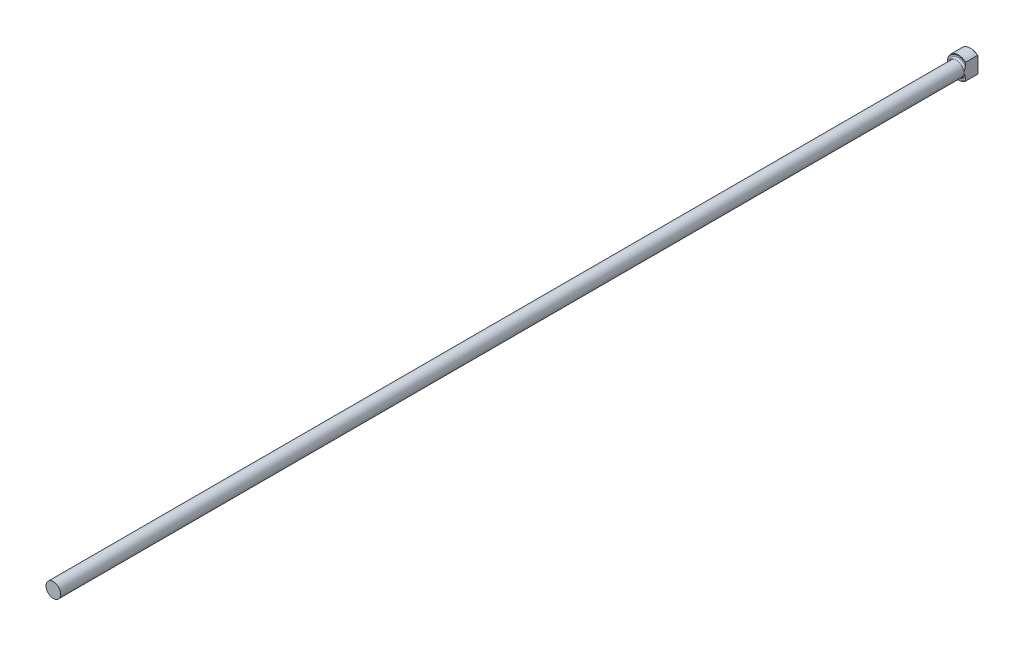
ISO-10303-21;
HEADER;
FILE_DESCRIPTION(('STEP AP214'),'2;1');
FILE_NAME('part.step','',(''),(''),'','','');
FILE_SCHEMA(('AUTOMOTIVE_DESIGN { 1 0 10303 214 1 1 1 1 }'));
ENDSEC;
DATA;
#1=APPLICATION_CONTEXT('core data for automotive mechanical design processes');
#2=APPLICATION_PROTOCOL_DEFINITION('international standard','automotive_design',2000,#1);
#3=PRODUCT_CONTEXT('',#1,'mechanical');
#4=PRODUCT('Part','Part','',(#3));
#5=PRODUCT_RELATED_PRODUCT_CATEGORY('part','',(#4));
#6=PRODUCT_DEFINITION_FORMATION('','',#4);
#7=PRODUCT_DEFINITION_CONTEXT('part definition',#1,'design');
#8=PRODUCT_DEFINITION('design','',#6,#7);
#9=PRODUCT_DEFINITION_SHAPE('','',#8);
#10=(LENGTH_UNIT() NAMED_UNIT(*) SI_UNIT(.MILLI.,.METRE.));
#11=(NAMED_UNIT(*) PLANE_ANGLE_UNIT() SI_UNIT($,.RADIAN.));
#12=(NAMED_UNIT(*) SI_UNIT($,.STERADIAN.) SOLID_ANGLE_UNIT());
#13=UNCERTAINTY_MEASURE_WITH_UNIT(LENGTH_MEASURE(1.E-05),#10,'distance_accuracy_value','');
#14=(GEOMETRIC_REPRESENTATION_CONTEXT(3) GLOBAL_UNCERTAINTY_ASSIGNED_CONTEXT((#13)) GLOBAL_UNIT_ASSIGNED_CONTEXT((#10,
#11,#12)) REPRESENTATION_CONTEXT('',''));
#15=CARTESIAN_POINT('',(0.,0.,0.));
#16=DIRECTION('',(0.,0.,1.));
#17=DIRECTION('',(1.,0.,0.));
#18=AXIS2_PLACEMENT_3D('',#15,#16,#17);
#19=CARTESIAN_POINT('',(0.,3.63473999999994,457.2));
#20=DIRECTION('',(0.,0.,1.));
#21=DIRECTION('',(1.,0.,0.));
#22=AXIS2_PLACEMENT_3D('',#19,#20,#21);
#23=PLANE('',#22);
#24=CARTESIAN_POINT('',(0.,0.,457.2));
#25=DIRECTION('',(0.,0.,-1.));
#26=DIRECTION('',(-1.,0.,0.));
#27=AXIS2_PLACEMENT_3D('',#24,#25,#26);
#28=CIRCLE('',#27,3.63473999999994);
#29=CARTESIAN_POINT('',(-3.63473999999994,0.,457.2));
#30=VERTEX_POINT('',#29);
#31=EDGE_CURVE('E96',#30,#30,#28,.T.);
#32=ORIENTED_EDGE('',*,*,#31,.F.);
#33=EDGE_LOOP('',(#32));
#34=FACE_BOUND('',#33,.T.);
#35=ADVANCED_FACE('F32',(#34),#23,.T.);
#36=CARTESIAN_POINT('',(0.,0.,-25.4347445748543));
#37=DIRECTION('',(0.,0.,-1.));
#38=DIRECTION('',(-1.,0.,0.));
#39=AXIS2_PLACEMENT_3D('',#36,#37,#38);
#40=CYLINDRICAL_SURFACE('',#39,3.63473999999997);
#41=ORIENTED_EDGE('',*,*,#31,.T.);
#42=EDGE_LOOP('',(#41));
#43=FACE_BOUND('',#42,.T.);
#44=CARTESIAN_POINT('',(0.,0.,7.112));
#45=DIRECTION('',(0.,0.,-1.));
#46=DIRECTION('',(-1.,0.,0.));
#47=AXIS2_PLACEMENT_3D('',#44,#45,#46);
#48=CIRCLE('',#47,3.63474);
#49=CARTESIAN_POINT('',(3.63474,0.,7.112));
#50=VERTEX_POINT('',#49);
#51=EDGE_CURVE('E101',#50,#50,#48,.T.);
#52=ORIENTED_EDGE('',*,*,#51,.F.);
#53=EDGE_LOOP('',(#52));
#54=FACE_BOUND('',#53,.T.);
#55=ADVANCED_FACE('F158',(#43,#54),#40,.T.);
#56=CARTESIAN_POINT('',(0.,0.,7.112));
#57=DIRECTION('',(0.,0.,-1.));
#58=DIRECTION('',(-1.,0.,0.));
#59=AXIS2_PLACEMENT_3D('',#56,#57,#58);
#60=TOROIDAL_SURFACE('',#59,4.39674,0.761999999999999);
#61=CARTESIAN_POINT('',(3.63474,0.,7.112));
#62=CARTESIAN_POINT('',(3.63474,-1.74344946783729E-12,7.11199899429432));
#63=CARTESIAN_POINT('',(3.63474,1.78498334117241E-07,7.11199798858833));
#64=CARTESIAN_POINT('',(3.63474,7.62263791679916E-07,7.11199603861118));
#65=CARTESIAN_POINT('',(3.63474,1.17158642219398E-06,7.11199509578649));
#66=CARTESIAN_POINT('',(3.63474,2.1612376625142E-06,7.11199322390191));
#67=CARTESIAN_POINT('',(3.63474,2.75126191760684E-06,7.11199230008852));
#68=CARTESIAN_POINT('',(3.63474,4.03652646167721E-06,7.11199053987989));
#69=CARTESIAN_POINT('',(3.63474,4.73118020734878E-06,7.11198970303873));
#70=CARTESIAN_POINT('',(3.63474,7.18105103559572E-06,7.11198696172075));
#71=CARTESIAN_POINT('',(3.63474,9.07519299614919E-06,7.11198518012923));
#72=CARTESIAN_POINT('',(3.63474,1.30322584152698E-05,7.11198194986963));
#73=CARTESIAN_POINT('',(3.63474,1.50893158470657E-05,7.11198049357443));
#74=CARTESIAN_POINT('',(3.63474,2.29434135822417E-05,7.11197518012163));
#75=CARTESIAN_POINT('',(3.63474,2.89441356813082E-05,7.11197161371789));
#76=CARTESIAN_POINT('',(3.63474,4.09147041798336E-05,7.11196563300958));
#77=CARTESIAN_POINT('',(3.63474,4.68525012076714E-05,7.11196315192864));
#78=CARTESIAN_POINT('',(3.63474,7.1644418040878E-05,7.11195289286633));
#79=CARTESIAN_POINT('',(3.63474,9.05656834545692E-05,7.11194530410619));
#80=CARTESIAN_POINT('',(3.63474,0.000126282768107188,7.11193284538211));
#81=CARTESIAN_POINT('',(3.63474,0.000142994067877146,7.11192774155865));
#82=CARTESIAN_POINT('',(3.63474,0.000262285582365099,7.11188809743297));
#83=CARTESIAN_POINT('',(3.63474,0.000359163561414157,7.11183858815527));
#84=CARTESIAN_POINT('',(3.63474,0.000732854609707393,7.11165477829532));
#85=CARTESIAN_POINT('',(3.63474,0.00101364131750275,7.11153159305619));
#86=CARTESIAN_POINT('',(3.63473999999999,0.00209315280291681,7.11105073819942));
#87=CARTESIAN_POINT('',(3.63474,0.0028877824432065,7.11068142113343));
#88=CARTESIAN_POINT('',(3.63474,0.00610639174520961,7.10919295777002));
#89=CARTESIAN_POINT('',(3.63474,0.00853491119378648,7.10808693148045));
#90=CARTESIAN_POINT('',(3.63473999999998,0.0422909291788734,7.09270387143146));
#91=CARTESIAN_POINT('',(3.63473999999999,0.0735849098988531,7.07832930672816));
#92=CARTESIAN_POINT('',(3.63474,0.136642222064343,7.04947209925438));
#93=CARTESIAN_POINT('',(3.63474,0.168406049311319,7.03499071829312));
#94=CARTESIAN_POINT('',(3.63473999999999,0.261065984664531,6.99286174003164));
#95=CARTESIAN_POINT('',(3.63474,0.322003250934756,6.96530107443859));
#96=CARTESIAN_POINT('',(3.63474,0.450965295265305,6.90766146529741));
#97=CARTESIAN_POINT('',(3.63474,0.519018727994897,6.87764661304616));
#98=CARTESIAN_POINT('',(3.63474,0.656239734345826,6.81834826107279));
#99=CARTESIAN_POINT('',(3.63474,0.72541168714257,6.78907483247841));
#100=CARTESIAN_POINT('',(3.63474,0.847105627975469,6.73906299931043));
#101=CARTESIAN_POINT('',(3.63474,0.899497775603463,6.71800992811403));
#102=CARTESIAN_POINT('',(3.63474,1.00454845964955,6.67695428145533));
#103=CARTESIAN_POINT('',(3.63474,1.05720607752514,6.65694934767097));
#104=CARTESIAN_POINT('',(3.63474,1.21365089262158,6.59952009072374));
#105=CARTESIAN_POINT('',(3.63474,1.31807181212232,6.56377668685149));
#106=CARTESIAN_POINT('',(3.63474,1.49628557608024,6.50859760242));
#107=CARTESIAN_POINT('',(3.63474,1.56957331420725,6.48753547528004));
#108=CARTESIAN_POINT('',(3.63474,1.71750588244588,6.44892937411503));
#109=CARTESIAN_POINT('',(3.63474,1.79215591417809,6.43140508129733));
#110=CARTESIAN_POINT('',(3.63474,1.94621928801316,6.40000137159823));
#111=CARTESIAN_POINT('',(3.63474,2.02568099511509,6.38635418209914));
#112=CARTESIAN_POINT('',(3.63474,2.18539345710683,6.36502426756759));
#113=CARTESIAN_POINT('',(3.63474,2.26564390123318,6.35733928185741));
#114=CARTESIAN_POINT('',(3.63474,2.4403343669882,6.34851963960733));
#115=CARTESIAN_POINT('',(3.63474,2.53485308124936,6.34873058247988));
#116=CARTESIAN_POINT('',(3.63474,2.72206173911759,6.36165439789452));
#117=CARTESIAN_POINT('',(3.63474,2.81475996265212,6.37421570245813));
#118=CARTESIAN_POINT('',(3.63474,2.97031424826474,6.40897537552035));
#119=CARTESIAN_POINT('',(3.63474,3.03401911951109,6.4273158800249));
#120=CARTESIAN_POINT('',(3.63474,3.15819399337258,6.47330401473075));
#121=CARTESIAN_POINT('',(3.63474,3.21866165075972,6.5009582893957));
#122=CARTESIAN_POINT('',(3.63474,3.31632345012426,6.55712349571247));
#123=CARTESIAN_POINT('',(3.63474,3.35507555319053,6.5829127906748));
#124=CARTESIAN_POINT('',(3.63474,3.42814101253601,6.6401577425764));
#125=CARTESIAN_POINT('',(3.63474,3.46246250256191,6.67160275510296));
#126=CARTESIAN_POINT('',(3.63474,3.51821035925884,6.73294148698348));
#127=CARTESIAN_POINT('',(3.63474,3.54082748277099,6.76174753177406));
#128=CARTESIAN_POINT('',(3.63474,3.58108240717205,6.82268617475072));
#129=CARTESIAN_POINT('',(3.63474,3.59872205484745,6.85481753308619));
#130=CARTESIAN_POINT('',(3.63474,3.62801553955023,6.92207308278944));
#131=CARTESIAN_POINT('',(3.63474,3.63961636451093,6.95722072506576));
#132=CARTESIAN_POINT('',(3.63474,3.65563254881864,7.02911724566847));
#133=CARTESIAN_POINT('',(3.63474,3.66005463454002,7.06586459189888));
#134=CARTESIAN_POINT('',(3.63474,3.66124171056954,7.13429247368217));
#135=CARTESIAN_POINT('',(3.63474,3.65899524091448,7.16595948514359));
#136=CARTESIAN_POINT('',(3.63474,3.64908172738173,7.2284247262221));
#137=CARTESIAN_POINT('',(3.63474,3.64141514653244,7.25922302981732));
#138=CARTESIAN_POINT('',(3.63474,3.62137123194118,7.31848664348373));
#139=CARTESIAN_POINT('',(3.63474,3.60909861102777,7.34698785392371));
#140=CARTESIAN_POINT('',(3.63474,3.58048272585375,7.40185007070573));
#141=CARTESIAN_POINT('',(3.63474,3.56413806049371,7.42821033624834));
#142=CARTESIAN_POINT('',(3.63474,3.5206361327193,7.48883472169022));
#143=CARTESIAN_POINT('',(3.63474,3.49179605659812,7.52189344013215));
#144=CARTESIAN_POINT('',(3.63474,3.42913585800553,7.58291812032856));
#145=CARTESIAN_POINT('',(3.63474,3.39530386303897,7.61087157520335));
#146=CARTESIAN_POINT('',(3.63474,3.30942968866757,7.67233440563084));
#147=CARTESIAN_POINT('',(3.63474,3.25563153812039,7.7033809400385));
#148=CARTESIAN_POINT('',(3.63474,3.14400577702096,7.75659339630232));
#149=CARTESIAN_POINT('',(3.63474,3.08617990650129,7.77876312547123));
#150=CARTESIAN_POINT('',(3.63474,2.93528161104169,7.8257752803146));
#151=CARTESIAN_POINT('',(3.63474,2.84054021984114,7.84521095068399));
#152=CARTESIAN_POINT('',(3.63474,2.64821810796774,7.8697939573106));
#153=CARTESIAN_POINT('',(3.63474,2.55061639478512,7.87474836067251));
#154=CARTESIAN_POINT('',(3.63474,2.36383615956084,7.87314445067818));
#155=CARTESIAN_POINT('',(3.63474,2.27464176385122,7.86752224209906));
#156=CARTESIAN_POINT('',(3.63474,2.09692980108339,7.84845083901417));
#157=CARTESIAN_POINT('',(3.63474,2.00841429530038,7.83498343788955));
#158=CARTESIAN_POINT('',(3.63474,1.83711061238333,7.80260031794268));
#159=CARTESIAN_POINT('',(3.63474,1.75426130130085,7.78399899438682));
#160=CARTESIAN_POINT('',(3.63474,1.59022963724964,7.74231897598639));
#161=CARTESIAN_POINT('',(3.63474,1.50904037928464,7.71926703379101));
#162=CARTESIAN_POINT('',(3.63474,1.32276260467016,7.66178077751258));
#163=CARTESIAN_POINT('',(3.63474,1.21808139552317,7.62603474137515));
#164=CARTESIAN_POINT('',(3.63474,1.06123677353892,7.56856460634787));
#165=CARTESIAN_POINT('',(3.63474,1.00843579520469,7.5485365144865));
#166=CARTESIAN_POINT('',(3.63474,0.903101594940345,7.5074250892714));
#167=CARTESIAN_POINT('',(3.63474,0.850569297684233,7.48633937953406));
#168=CARTESIAN_POINT('',(3.63474,0.728434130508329,7.43619381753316));
#169=CARTESIAN_POINT('',(3.63474,0.658963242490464,7.40681377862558));
#170=CARTESIAN_POINT('',(3.63474,0.521152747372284,7.34728987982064));
#171=CARTESIAN_POINT('',(3.63474,0.452808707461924,7.31715621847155));
#172=CARTESIAN_POINT('',(3.63474,0.323301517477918,7.25928448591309));
#173=CARTESIAN_POINT('',(3.63473999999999,0.262109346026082,7.23161133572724));
#174=CARTESIAN_POINT('',(3.63474,0.169062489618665,7.18930864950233));
#175=CARTESIAN_POINT('',(3.63474,0.137166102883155,7.17476722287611));
#176=CARTESIAN_POINT('',(3.63473999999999,0.0738458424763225,7.14579006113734));
#177=CARTESIAN_POINT('',(3.63473999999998,0.0424214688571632,7.13135559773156));
#178=CARTESIAN_POINT('',(3.63474,0.0085348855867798,7.11591305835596));
#179=CARTESIAN_POINT('',(3.63474,0.00610634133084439,7.11480701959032));
#180=CARTESIAN_POINT('',(3.63474,0.00288772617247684,7.11331855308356));
#181=CARTESIAN_POINT('',(3.63473999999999,0.00209311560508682,7.11294924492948));
#182=CARTESIAN_POINT('',(3.63474,0.00101362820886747,7.11246840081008));
#183=CARTESIAN_POINT('',(3.63474,0.000732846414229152,7.11234521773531));
#184=CARTESIAN_POINT('',(3.63474,0.00035916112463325,7.11216141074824));
#185=CARTESIAN_POINT('',(3.63474,0.000262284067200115,7.1121119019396));
#186=CARTESIAN_POINT('',(3.63474,0.000142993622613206,7.11207225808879));
#187=CARTESIAN_POINT('',(3.63474,0.00012628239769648,7.11206715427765));
#188=CARTESIAN_POINT('',(3.63474,9.05654743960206E-05,7.11205469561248));
#189=CARTESIAN_POINT('',(3.63474,7.16442934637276E-05,7.11204710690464));
#190=CARTESIAN_POINT('',(3.63474,4.68524715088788E-05,7.11203684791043));
#191=CARTESIAN_POINT('',(3.63474,4.09146867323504E-05,7.11203436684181));
#192=CARTESIAN_POINT('',(3.63474,2.89441407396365E-05,7.11202838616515));
#193=CARTESIAN_POINT('',(3.63474,2.294342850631E-05,7.11202481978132));
#194=CARTESIAN_POINT('',(3.63474,1.50893396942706E-05,7.11201950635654));
#195=CARTESIAN_POINT('',(3.63474,1.30322831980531E-05,7.11201805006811));
#196=CARTESIAN_POINT('',(3.63474,9.07521827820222E-06,7.11201481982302));
#197=CARTESIAN_POINT('',(3.63474,7.18107583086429E-06,7.11201303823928));
#198=CARTESIAN_POINT('',(3.63474,4.73120269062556E-06,7.11201029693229));
#199=CARTESIAN_POINT('',(3.63474,4.03654795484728E-06,7.11200946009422));
#200=CARTESIAN_POINT('',(3.63474,2.75128088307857E-06,7.11200769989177));
#201=CARTESIAN_POINT('',(3.63474,2.16125508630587E-06,7.11200677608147));
#202=CARTESIAN_POINT('',(3.63474,1.1716001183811E-06,7.11200490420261));
#203=CARTESIAN_POINT('',(3.63474,7.62275360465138E-07,7.11200396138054));
#204=CARTESIAN_POINT('',(3.63474,1.78504786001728E-07,7.11200201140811));
#205=CARTESIAN_POINT('',(3.63474,1.74383367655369E-12,7.11200100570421));
#206=CARTESIAN_POINT('',(3.63474,0.,7.112));
#207=B_SPLINE_CURVE_WITH_KNOTS('',3,(#61,#62,#63,#64,#65,#66,#67,#68,#69,#70,#71,#72,#73,#74,
#75,#76,#77,#78,#79,#80,#81,#82,#83,#84,#85,#86,#87,#88,#89,#90,#91,#92,#93,#94,#95,#96,#97,#98,
#99,#100,#101,#102,#103,#104,#105,#106,#107,#108,#109,#110,#111,#112,#113,#114,#115,#116,#117,
#118,#119,#120,#121,#122,#123,#124,#125,#126,#127,#128,#129,#130,#131,#132,#133,#134,#135,#136,
#137,#138,#139,#140,#141,#142,#143,#144,#145,#146,#147,#148,#149,#150,#151,#152,#153,#154,#155,
#156,#157,#158,#159,#160,#161,#162,#163,#164,#165,#166,#167,#168,#169,#170,#171,#172,#173,#174,
#175,#176,#177,#178,#179,#180,#181,#182,#183,#184,#185,#186,#187,#188,#189,#190,#191,#192,#193,
#194,#195,#196,#197,#198,#199,#200,#201,#202,#203,#204,#205,#206),.UNSPECIFIED.,.T.,.F.,(4,2,2,
2,2,2,2,2,2,2,2,2,2,2,2,2,2,2,2,2,2,2,2,2,2,2,2,2,2,2,2,2,2,2,2,2,2,2,2,2,2,2,2,2,2,2,2,2,2,2,2,
2,2,2,2,2,2,2,2,2,2,2,2,2,2,2,2,2,2,2,2,2,4),(0.,3.01414719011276E-06,6.08300473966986E-06,
9.35948019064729E-06,1.26182282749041E-05,2.03807095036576E-05,2.79356666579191E-05,
4.88018920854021E-05,6.80885541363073E-05,0.000129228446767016,0.00018159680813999,
0.000506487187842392,0.00142754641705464,0.00405483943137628,0.0120619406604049,
0.115361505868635,0.220092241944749,0.420728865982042,0.643859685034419,0.869180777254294,
1.03856258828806,1.20754529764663,1.53848522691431,1.76717479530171,1.99710350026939,
2.23879063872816,2.48038609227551,2.76331480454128,3.04281411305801,3.24114783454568,
3.43962334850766,3.57883259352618,3.71778252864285,3.82723637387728,3.93664955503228,
4.04700768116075,4.15726234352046,4.25202603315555,4.34678162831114,4.43950208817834,
4.53225449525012,4.6631354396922,4.79433283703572,4.97963569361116,5.16485898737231,
5.45339712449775,5.74576229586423,6.01345941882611,6.28178028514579,6.53635772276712,
6.78945003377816,7.12113276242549,7.29054177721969,7.46035016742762,7.68662149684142,
7.91069373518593,8.11216614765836,8.21733347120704,8.32106345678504,8.32907064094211,
8.3316978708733,8.33261891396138,8.33294380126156,8.3329961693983,8.33305730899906,
8.33307659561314,8.33309746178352,8.3331050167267,8.33311277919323,8.3331160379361,
8.33311931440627,8.3331223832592,8.33312539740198),.UNSPECIFIED.);
#208=CARTESIAN_POINT('',(3.63474,2.47386090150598,6.35));
#209=VERTEX_POINT('',#208);
#210=EDGE_CURVE('E136',#50,#209,#207,.T.);
#211=ORIENTED_EDGE('',*,*,#210,.T.);
#212=CARTESIAN_POINT('',(0.,0.,6.35));
#213=DIRECTION('',(0.,0.,-1.));
#214=DIRECTION('',(-1.,0.,0.));
#215=AXIS2_PLACEMENT_3D('',#212,#213,#214);
#216=CIRCLE('',#215,4.39674);
#217=CARTESIAN_POINT('',(3.63474,-2.47386090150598,6.35));
#218=VERTEX_POINT('',#217);
#219=EDGE_CURVE('E149',#218,#209,#216,.T.);
#220=ORIENTED_EDGE('',*,*,#219,.F.);
#221=CARTESIAN_POINT('',(3.63474,0.,7.112));
#222=CARTESIAN_POINT('',(3.63474,1.74370309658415E-12,7.11200100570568));
#223=CARTESIAN_POINT('',(3.63474,-1.78498333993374E-07,7.11200201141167));
#224=CARTESIAN_POINT('',(3.63474,-7.62263791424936E-07,7.11200396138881));
#225=CARTESIAN_POINT('',(3.63474,-1.17158642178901E-06,7.1120049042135));
#226=CARTESIAN_POINT('',(3.63474,-2.16123766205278E-06,7.11200677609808));
#227=CARTESIAN_POINT('',(3.63474,-2.75126191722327E-06,7.11200769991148));
#228=CARTESIAN_POINT('',(3.63474,-4.03652646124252E-06,7.11200946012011));
#229=CARTESIAN_POINT('',(3.63474,-4.73118020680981E-06,7.11201029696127));
#230=CARTESIAN_POINT('',(3.63474,-7.18105103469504E-06,7.11201303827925));
#231=CARTESIAN_POINT('',(3.63474,-9.0751929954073E-06,7.11201481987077));
#232=CARTESIAN_POINT('',(3.63474,-1.30322584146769E-05,7.11201805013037));
#233=CARTESIAN_POINT('',(3.63474,-1.50893158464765E-05,7.11201950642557));
#234=CARTESIAN_POINT('',(3.63474,-2.29434135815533E-05,7.11202481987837));
#235=CARTESIAN_POINT('',(3.63474,-2.8944135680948E-05,7.1120283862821));
#236=CARTESIAN_POINT('',(3.63474,-4.09147041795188E-05,7.11203436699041));
#237=CARTESIAN_POINT('',(3.63474,-4.68525012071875E-05,7.11203684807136));
#238=CARTESIAN_POINT('',(3.63474,-7.16444180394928E-05,7.11204710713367));
#239=CARTESIAN_POINT('',(3.63474,-9.05656834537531E-05,7.11205469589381));
#240=CARTESIAN_POINT('',(3.63474,-0.000126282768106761,7.11206715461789));
#241=CARTESIAN_POINT('',(3.63474,-0.000142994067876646,7.11207225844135));
#242=CARTESIAN_POINT('',(3.63473999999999,-0.000262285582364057,7.11211190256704));
#243=CARTESIAN_POINT('',(3.63474,-0.000359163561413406,7.11216141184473));
#244=CARTESIAN_POINT('',(3.63474,-0.000732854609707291,7.11234522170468));
#245=CARTESIAN_POINT('',(3.63474,-0.00101364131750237,7.11246840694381));
#246=CARTESIAN_POINT('',(3.63473999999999,-0.00209315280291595,7.11294926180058));
#247=CARTESIAN_POINT('',(3.63473999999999,-0.00288778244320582,7.11331857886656));
#248=CARTESIAN_POINT('',(3.63474,-0.00610639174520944,7.11480704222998));
#249=CARTESIAN_POINT('',(3.63474,-0.00853491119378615,7.11591306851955));
#250=CARTESIAN_POINT('',(3.63473999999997,-0.0422909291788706,7.13129612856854));
#251=CARTESIAN_POINT('',(3.63473999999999,-0.0735849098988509,7.14567069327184));
#252=CARTESIAN_POINT('',(3.63474,-0.136642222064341,7.17452790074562));
#253=CARTESIAN_POINT('',(3.63474,-0.168406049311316,7.18900928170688));
#254=CARTESIAN_POINT('',(3.63473999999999,-0.261065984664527,7.23113825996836));
#255=CARTESIAN_POINT('',(3.63473999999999,-0.322003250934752,7.25869892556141));
#256=CARTESIAN_POINT('',(3.63474,-0.450965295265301,7.31633853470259));
#257=CARTESIAN_POINT('',(3.63474,-0.519018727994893,7.34635338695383));
#258=CARTESIAN_POINT('',(3.63474,-0.656239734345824,7.40565173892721));
#259=CARTESIAN_POINT('',(3.63474,-0.725411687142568,7.43492516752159));
#260=CARTESIAN_POINT('',(3.63474,-0.847105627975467,7.48493700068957));
#261=CARTESIAN_POINT('',(3.63474,-0.899497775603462,7.50599007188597));
#262=CARTESIAN_POINT('',(3.63474,-1.00454845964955,7.54704571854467));
#263=CARTESIAN_POINT('',(3.63474,-1.05720607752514,7.56705065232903));
#264=CARTESIAN_POINT('',(3.63474,-1.21365089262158,7.62447990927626));
#265=CARTESIAN_POINT('',(3.63474,-1.31807181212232,7.66022331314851));
#266=CARTESIAN_POINT('',(3.63474,-1.49628557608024,7.71540239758));
#267=CARTESIAN_POINT('',(3.63474,-1.56957331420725,7.73646452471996));
#268=CARTESIAN_POINT('',(3.63474,-1.71750588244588,7.77507062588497));
#269=CARTESIAN_POINT('',(3.63474,-1.79215591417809,7.79259491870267));
#270=CARTESIAN_POINT('',(3.63474,-1.94621928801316,7.82399862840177));
#271=CARTESIAN_POINT('',(3.63474,-2.02568099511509,7.83764581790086));
#272=CARTESIAN_POINT('',(3.63474,-2.18539345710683,7.85897573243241));
#273=CARTESIAN_POINT('',(3.63474,-2.26564390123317,7.86666071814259));
#274=CARTESIAN_POINT('',(3.63474,-2.4403343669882,7.87548036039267));
#275=CARTESIAN_POINT('',(3.63474,-2.53485308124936,7.87526941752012));
#276=CARTESIAN_POINT('',(3.63474,-2.72206173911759,7.86234560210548));
#277=CARTESIAN_POINT('',(3.63474,-2.81475996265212,7.84978429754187));
#278=CARTESIAN_POINT('',(3.63474,-2.97031424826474,7.81502462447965));
#279=CARTESIAN_POINT('',(3.63474,-3.03401911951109,7.7966841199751));
#280=CARTESIAN_POINT('',(3.63474,-3.15819399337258,7.75069598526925));
#281=CARTESIAN_POINT('',(3.63474,-3.21866165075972,7.7230417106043));
#282=CARTESIAN_POINT('',(3.63474,-3.31632345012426,7.66687650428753));
#283=CARTESIAN_POINT('',(3.63474,-3.35507555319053,7.6410872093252));
#284=CARTESIAN_POINT('',(3.63474,-3.428141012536,7.5838422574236));
#285=CARTESIAN_POINT('',(3.63474,-3.46246250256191,7.55239724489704));
#286=CARTESIAN_POINT('',(3.63474,-3.51821035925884,7.49105851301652));
#287=CARTESIAN_POINT('',(3.63474,-3.54082748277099,7.46225246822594));
#288=CARTESIAN_POINT('',(3.63474,-3.58108240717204,7.40131382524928));
#289=CARTESIAN_POINT('',(3.63474,-3.59872205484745,7.36918246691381));
#290=CARTESIAN_POINT('',(3.63474,-3.62801553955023,7.30192691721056));
#291=CARTESIAN_POINT('',(3.63474,-3.63961636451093,7.26677927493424));
#292=CARTESIAN_POINT('',(3.63474,-3.65563254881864,7.19488275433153));
#293=CARTESIAN_POINT('',(3.63474,-3.66005463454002,7.15813540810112));
#294=CARTESIAN_POINT('',(3.63474,-3.66124171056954,7.08970752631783));
#295=CARTESIAN_POINT('',(3.63474,-3.65899524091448,7.05804051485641));
#296=CARTESIAN_POINT('',(3.63474,-3.64908172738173,6.9955752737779));
#297=CARTESIAN_POINT('',(3.63474,-3.64141514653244,6.96477697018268));
#298=CARTESIAN_POINT('',(3.63474,-3.62137123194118,6.90551335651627));
#299=CARTESIAN_POINT('',(3.63474,-3.60909861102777,6.87701214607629));
#300=CARTESIAN_POINT('',(3.63474,-3.58048272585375,6.82214992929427));
#301=CARTESIAN_POINT('',(3.63474,-3.56413806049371,6.79578966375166));
#302=CARTESIAN_POINT('',(3.63474,-3.5206361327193,6.73516527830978));
#303=CARTESIAN_POINT('',(3.63474,-3.49179605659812,6.70210655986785));
#304=CARTESIAN_POINT('',(3.63474,-3.42913585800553,6.64108187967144));
#305=CARTESIAN_POINT('',(3.63474,-3.39530386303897,6.61312842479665));
#306=CARTESIAN_POINT('',(3.63474,-3.30942968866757,6.55166559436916));
#307=CARTESIAN_POINT('',(3.63474,-3.25563153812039,6.5206190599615));
#308=CARTESIAN_POINT('',(3.63474,-3.14400577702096,6.46740660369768));
#309=CARTESIAN_POINT('',(3.63474,-3.08617990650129,6.44523687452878));
#310=CARTESIAN_POINT('',(3.63474,-2.93528161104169,6.3982247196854));
#311=CARTESIAN_POINT('',(3.63474,-2.84054021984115,6.37878904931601));
#312=CARTESIAN_POINT('',(3.63474,-2.64821810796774,6.3542060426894));
#313=CARTESIAN_POINT('',(3.63474,-2.55061639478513,6.34925163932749));
#314=CARTESIAN_POINT('',(3.63474,-2.36383615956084,6.35085554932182));
#315=CARTESIAN_POINT('',(3.63474,-2.27464176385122,6.35647775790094));
#316=CARTESIAN_POINT('',(3.63474,-2.0969298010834,6.37554916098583));
#317=CARTESIAN_POINT('',(3.63474,-2.00841429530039,6.38901656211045));
#318=CARTESIAN_POINT('',(3.63474,-1.83711061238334,6.42139968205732));
#319=CARTESIAN_POINT('',(3.63474,-1.75426130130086,6.44000100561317));
#320=CARTESIAN_POINT('',(3.63474,-1.59022963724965,6.48168102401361));
#321=CARTESIAN_POINT('',(3.63474,-1.50904037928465,6.50473296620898));
#322=CARTESIAN_POINT('',(3.63474,-1.32276260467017,6.56221922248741));
#323=CARTESIAN_POINT('',(3.63474,-1.21808139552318,6.59796525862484));
#324=CARTESIAN_POINT('',(3.63474,-1.06123677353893,6.65543539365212));
#325=CARTESIAN_POINT('',(3.63474,-1.00843579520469,6.6754634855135));
#326=CARTESIAN_POINT('',(3.63474,-0.903101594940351,6.71657491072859));
#327=CARTESIAN_POINT('',(3.63474,-0.850569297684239,6.73766062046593));
#328=CARTESIAN_POINT('',(3.63474,-0.728434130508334,6.78780618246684));
#329=CARTESIAN_POINT('',(3.63474,-0.658963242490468,6.81718622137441));
#330=CARTESIAN_POINT('',(3.63474,-0.521152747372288,6.87671012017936));
#331=CARTESIAN_POINT('',(3.63474,-0.452808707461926,6.90684378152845));
#332=CARTESIAN_POINT('',(3.63473999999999,-0.323301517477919,6.96471551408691));
#333=CARTESIAN_POINT('',(3.63473999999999,-0.262109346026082,6.99238866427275));
#334=CARTESIAN_POINT('',(3.63474,-0.169062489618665,7.03469135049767));
#335=CARTESIAN_POINT('',(3.63474,-0.137166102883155,7.04923277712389));
#336=CARTESIAN_POINT('',(3.63473999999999,-0.0738458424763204,7.07820993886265));
#337=CARTESIAN_POINT('',(3.63473999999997,-0.0424214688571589,7.09264440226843));
#338=CARTESIAN_POINT('',(3.63474,-0.00853488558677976,7.10808694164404));
#339=CARTESIAN_POINT('',(3.63474,-0.00610634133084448,7.10919298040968));
#340=CARTESIAN_POINT('',(3.63473999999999,-0.00288772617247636,7.11068144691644));
#341=CARTESIAN_POINT('',(3.63473999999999,-0.00209311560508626,7.11105075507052));
#342=CARTESIAN_POINT('',(3.63474,-0.00101362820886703,7.11153159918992));
#343=CARTESIAN_POINT('',(3.63474,-0.000732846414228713,7.11165478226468));
#344=CARTESIAN_POINT('',(3.63474,-0.000359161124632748,7.11183858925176));
#345=CARTESIAN_POINT('',(3.63473999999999,-0.000262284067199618,7.1118880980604));
#346=CARTESIAN_POINT('',(3.63474,-0.000142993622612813,7.11192774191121));
#347=CARTESIAN_POINT('',(3.63474,-0.000126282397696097,7.11193284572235));
#348=CARTESIAN_POINT('',(3.63474,-9.05654743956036E-05,7.11194530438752));
#349=CARTESIAN_POINT('',(3.63474,-7.16442934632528E-05,7.11195289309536));
#350=CARTESIAN_POINT('',(3.63474,-4.68524715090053E-05,7.11196315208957));
#351=CARTESIAN_POINT('',(3.63474,-4.09146867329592E-05,7.11196563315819));
#352=CARTESIAN_POINT('',(3.63474,-2.89441407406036E-05,7.11197161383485));
#353=CARTESIAN_POINT('',(3.63474,-2.29434285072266E-05,7.11197518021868));
#354=CARTESIAN_POINT('',(3.63474,-1.50893396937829E-05,7.11198049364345));
#355=CARTESIAN_POINT('',(3.63474,-1.30322831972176E-05,7.11198194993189));
#356=CARTESIAN_POINT('',(3.63474,-9.07521827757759E-06,7.11198518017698));
#357=CARTESIAN_POINT('',(3.63474,-7.18107583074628E-06,7.11198696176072));
#358=CARTESIAN_POINT('',(3.63474,-4.73120269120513E-06,7.11198970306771));
#359=CARTESIAN_POINT('',(3.63474,-4.03654795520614E-06,7.11199053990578));
#360=CARTESIAN_POINT('',(3.63474,-2.75128088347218E-06,7.11199230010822));
#361=CARTESIAN_POINT('',(3.63474,-2.16125508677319E-06,7.11199322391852));
#362=CARTESIAN_POINT('',(3.63474,-1.17160011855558E-06,7.11199509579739));
#363=CARTESIAN_POINT('',(3.63474,-7.62275360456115E-07,7.11199603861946));
#364=CARTESIAN_POINT('',(3.63474,-1.7850478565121E-07,7.11199798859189));
#365=CARTESIAN_POINT('',(3.63474,-1.7433137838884E-12,7.11199899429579));
#366=CARTESIAN_POINT('',(3.63474,0.,7.112));
#367=B_SPLINE_CURVE_WITH_KNOTS('',3,(#221,#222,#223,#224,#225,#226,#227,#228,#229,#230,#231,
#232,#233,#234,#235,#236,#237,#238,#239,#240,#241,#242,#243,#244,#245,#246,#247,#248,#249,#250,
#251,#252,#253,#254,#255,#256,#257,#258,#259,#260,#261,#262,#263,#264,#265,#266,#267,#268,#269,
#270,#271,#272,#273,#274,#275,#276,#277,#278,#279,#280,#281,#282,#283,#284,#285,#286,#287,#288,
#289,#290,#291,#292,#293,#294,#295,#296,#297,#298,#299,#300,#301,#302,#303,#304,#305,#306,#307,
#308,#309,#310,#311,#312,#313,#314,#315,#316,#317,#318,#319,#320,#321,#322,#323,#324,#325,#326,
#327,#328,#329,#330,#331,#332,#333,#334,#335,#336,#337,#338,#339,#340,#341,#342,#343,#344,#345,
#346,#347,#348,#349,#350,#351,#352,#353,#354,#355,#356,#357,#358,#359,#360,#361,#362,#363,#364,
#365,#366),.UNSPECIFIED.,.T.,.F.,(4,2,2,2,2,2,2,2,2,2,2,2,2,2,2,2,2,2,2,2,2,2,2,2,2,2,2,2,2,2,2,
2,2,2,2,2,2,2,2,2,2,2,2,2,2,2,2,2,2,2,2,2,2,2,2,2,2,2,2,2,2,2,2,2,2,2,2,2,2,2,2,2,4),(0.,
3.01414718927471E-06,6.08300473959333E-06,9.35948019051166E-06,1.26182282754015E-05,
2.03807095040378E-05,2.79356666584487E-05,4.88018920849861E-05,6.80885541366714E-05,
0.00012922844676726,0.000181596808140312,0.00050648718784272,0.00142754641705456,
0.00405483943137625,0.0120619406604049,0.115361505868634,0.220092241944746,0.420728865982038,
0.643859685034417,0.869180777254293,1.03856258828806,1.20754529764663,1.53848522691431,
1.76717479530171,1.99710350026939,2.23879063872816,2.48038609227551,2.76331480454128,
3.04281411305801,3.24114783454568,3.43962334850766,3.57883259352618,3.71778252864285,
3.82723637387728,3.93664955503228,4.04700768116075,4.15726234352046,4.25202603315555,
4.34678162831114,4.43950208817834,4.53225449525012,4.6631354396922,4.79433283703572,
4.97963569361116,5.16485898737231,5.45339712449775,5.74576229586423,6.01345941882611,
6.28178028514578,6.53635772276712,6.78945003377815,7.12113276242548,7.29054177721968,
7.46035016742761,7.68662149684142,7.91069373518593,8.11216614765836,8.21733347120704,
8.32106345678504,8.32907064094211,8.3316978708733,8.33261891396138,8.33294380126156,
8.3329961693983,8.33305730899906,8.33307659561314,8.33309746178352,8.3331050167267,
8.33311277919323,8.3331160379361,8.33311931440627,8.33312238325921,8.33312539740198),.UNSPECIFIED.);
#368=EDGE_CURVE('E142',#218,#50,#367,.T.);
#369=ORIENTED_EDGE('',*,*,#368,.T.);
#370=ORIENTED_EDGE('',*,*,#51,.T.);
#371=EDGE_LOOP('',(#211,#220,#369,#370));
#372=FACE_BOUND('',#371,.T.);
#373=ADVANCED_FACE('F155',(#372),#60,.F.);
#374=CARTESIAN_POINT('',(0.,5.46099999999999,6.35));
#375=DIRECTION('',(0.,0.,1.));
#376=DIRECTION('',(1.,0.,0.));
#377=AXIS2_PLACEMENT_3D('',#374,#375,#376);
#378=PLANE('',#377);
#379=DIRECTION('',(0.,1.,0.));
#380=VECTOR('',#379,1.);
#381=CARTESIAN_POINT('',(3.63474,4.0756822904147,6.35000000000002));
#382=LINE('',#381,#380);
#383=CARTESIAN_POINT('',(3.63474,3.72847343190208,6.35));
#384=VERTEX_POINT('',#383);
#385=EDGE_CURVE('E112',#209,#384,#382,.T.);
#386=ORIENTED_EDGE('',*,*,#385,.T.);
#387=CARTESIAN_POINT('',(0.,0.,6.35));
#388=DIRECTION('',(0.,0.,1.));
#389=DIRECTION('',(1.,0.,0.));
#390=AXIS2_PLACEMENT_3D('',#387,#388,#389);
#391=CIRCLE('',#390,5.20699999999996);
#392=CARTESIAN_POINT('',(3.63474,-3.72847343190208,6.35));
#393=VERTEX_POINT('',#392);
#394=EDGE_CURVE('E11',#384,#393,#391,.T.);
#395=ORIENTED_EDGE('',*,*,#394,.T.);
#396=EDGE_CURVE('E47',#393,#218,#382,.T.);
#397=ORIENTED_EDGE('',*,*,#396,.T.);
#398=ORIENTED_EDGE('',*,*,#219,.T.);
#399=EDGE_LOOP('',(#386,#395,#397,#398));
#400=FACE_BOUND('',#399,.T.);
#401=ADVANCED_FACE('F166',(#400),#378,.T.);
#402=CARTESIAN_POINT('',(0.,0.,-25.4347445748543));
#403=DIRECTION('',(0.,0.,-1.));
#404=DIRECTION('',(-1.,0.,0.));
#405=AXIS2_PLACEMENT_3D('',#402,#403,#404);
#406=CYLINDRICAL_SURFACE('',#405,5.46099999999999);
#407=DIRECTION('',(0.,0.,-1.));
#408=VECTOR('',#407,1.);
#409=CARTESIAN_POINT('',(3.63474,4.0756822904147,457.201));
#410=LINE('',#409,#408);
#411=CARTESIAN_POINT('',(3.63474,4.0756822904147,6.09599999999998));
#412=VERTEX_POINT('',#411);
#413=CARTESIAN_POINT('',(3.63474,4.0756822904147,0.253999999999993));
#414=VERTEX_POINT('',#413);
#415=EDGE_CURVE('E108',#412,#414,#410,.T.);
#416=ORIENTED_EDGE('',*,*,#415,.T.);
#417=CARTESIAN_POINT('',(0.,0.,0.253999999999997));
#418=DIRECTION('',(0.,0.,-1.));
#419=DIRECTION('',(-1.,0.,0.));
#420=AXIS2_PLACEMENT_3D('',#417,#418,#419);
#421=CIRCLE('',#420,5.46099999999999);
#422=CARTESIAN_POINT('',(3.63474,-4.0756822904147,0.253999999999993));
#423=VERTEX_POINT('',#422);
#424=EDGE_CURVE('E40',#414,#423,#421,.F.);
#425=ORIENTED_EDGE('',*,*,#424,.T.);
#426=DIRECTION('',(0.,0.,-1.));
#427=VECTOR('',#426,1.);
#428=CARTESIAN_POINT('',(3.63474,-4.0756822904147,457.201));
#429=LINE('',#428,#427);
#430=CARTESIAN_POINT('',(3.63474,-4.0756822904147,6.09599999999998));
#431=VERTEX_POINT('',#430);
#432=EDGE_CURVE('E86',#431,#423,#429,.T.);
#433=ORIENTED_EDGE('',*,*,#432,.F.);
#434=CARTESIAN_POINT('',(0.,0.,6.09599999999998));
#435=DIRECTION('',(0.,0.,1.));
#436=DIRECTION('',(1.,0.,0.));
#437=AXIS2_PLACEMENT_3D('',#434,#435,#436);
#438=CIRCLE('',#437,5.46099999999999);
#439=EDGE_CURVE('E95',#431,#412,#438,.F.);
#440=ORIENTED_EDGE('',*,*,#439,.T.);
#441=EDGE_LOOP('',(#416,#425,#433,#440));
#442=FACE_BOUND('',#441,.T.);
#443=ADVANCED_FACE('F106',(#442),#406,.T.);
#444=CARTESIAN_POINT('',(0.,0.,0.));
#445=DIRECTION('',(0.,0.,-1.));
#446=DIRECTION('',(-1.,0.,0.));
#447=AXIS2_PLACEMENT_3D('',#444,#445,#446);
#448=PLANE('',#447);
#449=DIRECTION('',(0.,1.,0.));
#450=VECTOR('',#449,1.);
#451=CARTESIAN_POINT('',(3.63474,4.0756822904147,0.));
#452=LINE('',#451,#450);
#453=CARTESIAN_POINT('',(3.63474,-3.72847343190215,0.));
#454=VERTEX_POINT('',#453);
#455=CARTESIAN_POINT('',(3.63474,3.72847343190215,0.));
#456=VERTEX_POINT('',#455);
#457=EDGE_CURVE('E79',#454,#456,#452,.T.);
#458=ORIENTED_EDGE('',*,*,#457,.F.);
#459=CARTESIAN_POINT('',(0.,0.,0.));
#460=DIRECTION('',(0.,0.,-1.));
#461=DIRECTION('',(-1.,0.,0.));
#462=AXIS2_PLACEMENT_3D('',#459,#460,#461);
#463=CIRCLE('',#462,5.20700000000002);
#464=EDGE_CURVE('E91',#454,#456,#463,.T.);
#465=ORIENTED_EDGE('',*,*,#464,.T.);
#466=EDGE_LOOP('',(#458,#465));
#467=FACE_BOUND('',#466,.T.);
#468=ADVANCED_FACE('F94',(#467),#448,.T.);
#469=CARTESIAN_POINT('',(0.,0.,0.));
#470=DIRECTION('',(0.,0.,1.));
#471=DIRECTION('',(1.,0.,0.));
#472=AXIS2_PLACEMENT_3D('',#469,#470,#471);
#473=CONICAL_SURFACE('',#472,5.20700000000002,0.785398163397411);
#474=CARTESIAN_POINT('',(3.63474,8.96907488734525,4.4705843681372));
#475=CARTESIAN_POINT('',(3.63474,8.8341143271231,4.34550664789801));
#476=CARTESIAN_POINT('',(3.63474,8.69895768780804,4.22064058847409));
#477=CARTESIAN_POINT('',(3.63474,8.42819305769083,3.97139692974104));
#478=CARTESIAN_POINT('',(3.63474,8.29258506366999,3.84701933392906));
#479=CARTESIAN_POINT('',(3.63474,7.88493984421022,3.47466636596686));
#480=CARTESIAN_POINT('',(3.63474,7.61213925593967,3.22752455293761));
#481=CARTESIAN_POINT('',(3.63474,7.06222420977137,2.73474736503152));
#482=CARTESIAN_POINT('',(3.63474,6.78509370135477,2.4891298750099));
#483=CARTESIAN_POINT('',(3.63474,6.22721396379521,2.00208700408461));
#484=CARTESIAN_POINT('',(3.63474,5.9464651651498,1.76066113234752));
#485=CARTESIAN_POINT('',(3.63474,5.43683026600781,1.33177370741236));
#486=CARTESIAN_POINT('',(3.63474,5.20886445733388,1.14322070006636));
#487=CARTESIAN_POINT('',(3.63474,4.74853085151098,0.771406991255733));
#488=CARTESIAN_POINT('',(3.63474,4.51616200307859,0.588147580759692));
#489=CARTESIAN_POINT('',(3.63474,4.16329953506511,0.319180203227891));
#490=CARTESIAN_POINT('',(3.63474,4.04502737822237,0.230558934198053));
#491=CARTESIAN_POINT('',(3.63474,3.80673700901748,0.0557001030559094));
#492=CARTESIAN_POINT('',(3.63474,3.68671887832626,-0.0305375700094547));
#493=CARTESIAN_POINT('',(3.63474,3.44466659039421,-0.200044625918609));
#494=CARTESIAN_POINT('',(3.63474,3.32263322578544,-0.283315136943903));
#495=CARTESIAN_POINT('',(3.63474,3.076143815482,-0.446177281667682));
#496=CARTESIAN_POINT('',(3.63474,2.95168804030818,-0.525769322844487));
#497=CARTESIAN_POINT('',(3.63474,2.70391425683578,-0.677847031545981));
#498=CARTESIAN_POINT('',(3.63474,2.58068605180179,-0.750478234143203));
#499=CARTESIAN_POINT('',(3.63474,2.33109309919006,-0.890214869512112));
#500=CARTESIAN_POINT('',(3.63474,2.20472800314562,-0.95731968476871));
#501=CARTESIAN_POINT('',(3.63474,1.94852890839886,-1.08441165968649));
#502=CARTESIAN_POINT('',(3.63474,1.8186969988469,-1.14440299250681));
#503=CARTESIAN_POINT('',(3.63474,1.55519864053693,-1.25532778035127));
#504=CARTESIAN_POINT('',(3.63474,1.42153327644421,-1.30626376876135));
#505=CARTESIAN_POINT('',(3.63474,1.17999717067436,-1.38682208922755));
#506=CARTESIAN_POINT('',(3.63474,1.07287289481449,-1.41866962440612));
#507=CARTESIAN_POINT('',(3.63474,0.856532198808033,-1.4741640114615));
#508=CARTESIAN_POINT('',(3.63474,0.747316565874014,-1.49781388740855));
#509=CARTESIAN_POINT('',(3.63474,0.527606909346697,-1.53575461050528));
#510=CARTESIAN_POINT('',(3.63474,0.41711807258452,-1.5500750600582));
#511=CARTESIAN_POINT('',(3.63474,0.195291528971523,-1.56869464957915));
#512=CARTESIAN_POINT('',(3.63474,0.083953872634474,-1.57299438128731));
#513=CARTESIAN_POINT('',(3.63474,-0.138962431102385,-1.57131750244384));
#514=CARTESIAN_POINT('',(3.63474,-0.250540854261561,-1.56531139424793));
#515=CARTESIAN_POINT('',(3.63474,-0.472701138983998,-1.54331945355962));
#516=CARTESIAN_POINT('',(3.63474,-0.583282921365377,-1.52733283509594));
#517=CARTESIAN_POINT('',(3.63474,-0.803059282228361,-1.48617502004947));
#518=CARTESIAN_POINT('',(3.63474,-0.912248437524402,-1.46097524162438));
#519=CARTESIAN_POINT('',(3.63474,-1.12842386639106,-1.4025490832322));
#520=CARTESIAN_POINT('',(3.63474,-1.23541003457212,-1.36932232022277));
#521=CARTESIAN_POINT('',(3.63474,-1.57590400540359,-1.25147028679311));
#522=CARTESIAN_POINT('',(3.63474,-1.80483153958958,-1.15352708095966));
#523=CARTESIAN_POINT('',(3.63474,-2.14000486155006,-0.990193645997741));
#524=CARTESIAN_POINT('',(3.63474,-2.25048223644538,-0.932937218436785));
#525=CARTESIAN_POINT('',(3.63474,-2.4690084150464,-0.813944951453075));
#526=CARTESIAN_POINT('',(3.63474,-2.57705752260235,-0.752209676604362));
#527=CARTESIAN_POINT('',(3.63474,-2.79233423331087,-0.62432905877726));
#528=CARTESIAN_POINT('',(3.63474,-2.89953441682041,-0.558138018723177));
#529=CARTESIAN_POINT('',(3.63474,-3.11201051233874,-0.42272825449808));
#530=CARTESIAN_POINT('',(3.63474,-3.21728628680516,-0.35350931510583));
#531=CARTESIAN_POINT('',(3.63474,-3.53039522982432,-0.142299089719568));
#532=CARTESIAN_POINT('',(3.63474,-3.73573608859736,0.00338304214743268));
#533=CARTESIAN_POINT('',(3.63474,-4.16781896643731,0.320922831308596));
#534=CARTESIAN_POINT('',(3.63474,-4.39386438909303,0.493718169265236));
#535=CARTESIAN_POINT('',(3.63474,-4.84127989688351,0.845291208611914));
#536=CARTESIAN_POINT('',(3.63474,-5.06264931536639,1.02406975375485));
#537=CARTESIAN_POINT('',(3.63474,-5.50205754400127,1.38606259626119));
#538=CARTESIAN_POINT('',(3.63474,-5.72009311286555,1.56928081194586));
#539=CARTESIAN_POINT('',(3.63474,-6.15346469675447,1.93888548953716));
#540=CARTESIAN_POINT('',(3.63474,-6.36880064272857,2.12527203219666));
#541=CARTESIAN_POINT('',(3.63474,-6.78499461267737,2.48962118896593));
#542=CARTESIAN_POINT('',(3.63474,-6.98597086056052,2.66744903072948));
#543=CARTESIAN_POINT('',(3.63474,-7.3864224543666,3.02479289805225));
#544=CARTESIAN_POINT('',(3.63474,-7.58589777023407,3.20430895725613));
#545=CARTESIAN_POINT('',(3.63474,-7.98323319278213,3.5643328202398));
#546=CARTESIAN_POINT('',(3.63474,-8.18109571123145,3.74483796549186));
#547=CARTESIAN_POINT('',(3.63474,-8.57579863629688,4.10694555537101));
#548=CARTESIAN_POINT('',(3.63474,-8.77263908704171,4.2885479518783));
#549=CARTESIAN_POINT('',(3.63474,-8.96907488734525,4.4705843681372));
#550=B_SPLINE_CURVE_WITH_KNOTS('',3,(#474,#475,#476,#477,#478,#479,#480,#481,#482,#483,#484,
#485,#486,#487,#488,#489,#490,#491,#492,#493,#494,#495,#496,#497,#498,#499,#500,#501,#502,#503,
#504,#505,#506,#507,#508,#509,#510,#511,#512,#513,#514,#515,#516,#517,#518,#519,#520,#521,#522,
#523,#524,#525,#526,#527,#528,#529,#530,#531,#532,#533,#534,#535,#536,#537,#538,#539,#540,#541,
#542,#543,#544,#545,#546,#547,#548,#549),.UNSPECIFIED.,.F.,.F.,(4,2,2,2,2,2,2,2,2,2,2,2,2,2,2,2,
2,2,2,2,2,2,2,2,2,2,2,2,2,2,2,2,2,2,2,2,2,4),(0.,0.552022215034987,1.10404837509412,
2.20833762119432,3.3192400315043,4.43001146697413,5.31747848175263,6.20516012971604,
6.64850888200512,7.09183696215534,7.53499464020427,7.97810310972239,8.40711226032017,
8.83616928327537,9.26497333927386,9.69365724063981,10.0286591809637,10.3635374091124,
10.6973478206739,11.0311385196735,11.3658861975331,11.7006602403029,12.0364817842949,
12.3723193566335,13.1171246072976,13.4903888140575,13.863606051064,14.241516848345,
14.6194545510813,15.3745371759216,16.2279805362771,17.0815447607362,17.9358919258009,
18.7902608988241,19.5953133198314,20.400381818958,21.2038604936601,22.0073041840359),.UNSPECIFIED.);
#551=EDGE_CURVE('E82',#454,#423,#550,.T.);
#552=ORIENTED_EDGE('',*,*,#551,.T.);
#553=ORIENTED_EDGE('',*,*,#424,.F.);
#554=EDGE_CURVE('E54',#414,#456,#550,.T.);
#555=ORIENTED_EDGE('',*,*,#554,.T.);
#556=ORIENTED_EDGE('',*,*,#464,.F.);
#557=EDGE_LOOP('',(#552,#553,#555,#556));
#558=FACE_BOUND('',#557,.T.);
#559=ADVANCED_FACE('F90',(#558),#473,.T.);
#560=CARTESIAN_POINT('',(0.,0.,6.09599999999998));
#561=DIRECTION('',(0.,0.,-1.));
#562=DIRECTION('',(-1.,0.,0.));
#563=AXIS2_PLACEMENT_3D('',#560,#561,#562);
#564=CONICAL_SURFACE('',#563,5.46099999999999,0.785398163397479);
#565=CARTESIAN_POINT('',(3.63474,-8.96907488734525,1.87941563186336));
#566=CARTESIAN_POINT('',(3.63474,-8.83411432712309,2.00449335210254));
#567=CARTESIAN_POINT('',(3.63474,-8.69895768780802,2.12935941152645));
#568=CARTESIAN_POINT('',(3.63474,-8.42819305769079,2.37860307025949));
#569=CARTESIAN_POINT('',(3.63474,-8.29258506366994,2.50298066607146));
#570=CARTESIAN_POINT('',(3.63474,-7.88493984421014,2.87533363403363));
#571=CARTESIAN_POINT('',(3.63474,-7.61213925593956,3.12247544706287));
#572=CARTESIAN_POINT('',(3.63474,-7.06222420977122,3.61525263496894));
#573=CARTESIAN_POINT('',(3.63474,-6.7850937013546,3.86087012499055));
#574=CARTESIAN_POINT('',(3.63474,-6.22721396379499,4.34791299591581));
#575=CARTESIAN_POINT('',(3.63474,-5.94646516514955,4.58933886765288));
#576=CARTESIAN_POINT('',(3.63474,-5.43683026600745,5.01822629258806));
#577=CARTESIAN_POINT('',(3.63474,-5.20886445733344,5.2067792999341));
#578=CARTESIAN_POINT('',(3.63474,-4.74853085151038,5.5785930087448));
#579=CARTESIAN_POINT('',(3.63474,-4.51616200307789,5.76185241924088));
#580=CARTESIAN_POINT('',(3.63474,-4.16329953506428,6.03081979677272));
#581=CARTESIAN_POINT('',(3.63474,-4.04502737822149,6.11944106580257));
#582=CARTESIAN_POINT('',(3.63474,-3.80673700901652,6.29429989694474));
#583=CARTESIAN_POINT('',(3.63474,-3.68671887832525,6.38053757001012));
#584=CARTESIAN_POINT('',(3.63474,-3.44466659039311,6.55004462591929));
#585=CARTESIAN_POINT('',(3.63474,-3.32263322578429,6.63331513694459));
#586=CARTESIAN_POINT('',(3.63474,-3.07614381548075,6.79617728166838));
#587=CARTESIAN_POINT('',(3.63474,-2.95168804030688,6.87576932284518));
#588=CARTESIAN_POINT('',(3.63474,-2.70391425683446,7.02784703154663));
#589=CARTESIAN_POINT('',(3.63474,-2.58068605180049,7.1004782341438));
#590=CARTESIAN_POINT('',(3.63474,-2.33109309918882,7.24021486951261));
#591=CARTESIAN_POINT('',(3.63474,-2.2047280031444,7.30731968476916));
#592=CARTESIAN_POINT('',(3.63474,-1.94852890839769,7.43441165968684));
#593=CARTESIAN_POINT('',(3.63474,-1.81869699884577,7.49440299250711));
#594=CARTESIAN_POINT('',(3.63474,-1.55519864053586,7.60532778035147));
#595=CARTESIAN_POINT('',(3.63474,-1.42153327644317,7.6562637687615));
#596=CARTESIAN_POINT('',(3.63474,-1.17999717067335,7.73682208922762));
#597=CARTESIAN_POINT('',(3.63474,-1.07287289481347,7.76866962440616));
#598=CARTESIAN_POINT('',(3.63474,-0.856532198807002,7.82416401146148));
#599=CARTESIAN_POINT('',(3.63474,-0.747316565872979,7.8478138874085));
#600=CARTESIAN_POINT('',(3.63474,-0.527606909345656,7.88575461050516));
#601=CARTESIAN_POINT('',(3.63474,-0.417118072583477,7.90007506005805));
#602=CARTESIAN_POINT('',(3.63474,-0.195291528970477,7.91869464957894));
#603=CARTESIAN_POINT('',(3.63474,-0.0839538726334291,7.92299438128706));
#604=CARTESIAN_POINT('',(3.63474,0.138962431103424,7.92131750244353));
#605=CARTESIAN_POINT('',(3.63474,0.250540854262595,7.91531139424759));
#606=CARTESIAN_POINT('',(3.63474,0.472701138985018,7.89331945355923));
#607=CARTESIAN_POINT('',(3.63474,0.583282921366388,7.87733283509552));
#608=CARTESIAN_POINT('',(3.63474,0.803059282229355,7.836175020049));
#609=CARTESIAN_POINT('',(3.63474,0.912248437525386,7.81097524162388));
#610=CARTESIAN_POINT('',(3.63474,1.12842386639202,7.75254908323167));
#611=CARTESIAN_POINT('',(3.63474,1.23541003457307,7.71932232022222));
#612=CARTESIAN_POINT('',(3.63474,1.57590400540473,7.60147028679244));
#613=CARTESIAN_POINT('',(3.63474,1.8048315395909,7.50352708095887));
#614=CARTESIAN_POINT('',(3.63474,2.14000486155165,7.34019364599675));
#615=CARTESIAN_POINT('',(3.63474,2.25048223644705,7.28293721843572));
#616=CARTESIAN_POINT('',(3.63474,2.46900841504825,7.16394495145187));
#617=CARTESIAN_POINT('',(3.63474,2.57705752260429,7.10220967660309));
#618=CARTESIAN_POINT('',(3.63474,2.79233423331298,6.97432905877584));
#619=CARTESIAN_POINT('',(3.63474,2.8995344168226,6.90813801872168));
#620=CARTESIAN_POINT('',(3.63474,3.1120105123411,6.77272825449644));
#621=CARTESIAN_POINT('',(3.63474,3.21728628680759,6.70350931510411));
#622=CARTESIAN_POINT('',(3.63474,3.53039522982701,6.49229908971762));
#623=CARTESIAN_POINT('',(3.63474,3.73573608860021,6.34661695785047));
#624=CARTESIAN_POINT('',(3.63474,4.16781896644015,6.02907716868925));
#625=CARTESIAN_POINT('',(3.63474,4.3938643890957,5.85628183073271));
#626=CARTESIAN_POINT('',(3.63474,4.84127989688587,5.50470879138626));
#627=CARTESIAN_POINT('',(3.63474,5.0626493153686,5.32593024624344));
#628=CARTESIAN_POINT('',(3.63474,5.50205754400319,4.96393740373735));
#629=CARTESIAN_POINT('',(3.63474,5.72009311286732,4.7807191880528));
#630=CARTESIAN_POINT('',(3.63474,6.15346469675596,4.41111451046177));
#631=CARTESIAN_POINT('',(3.63474,6.36880064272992,4.22472796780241));
#632=CARTESIAN_POINT('',(3.63474,6.78499461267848,3.86037881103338));
#633=CARTESIAN_POINT('',(3.63474,6.98597086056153,3.68255096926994));
#634=CARTESIAN_POINT('',(3.63474,7.3864224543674,3.32520710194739));
#635=CARTESIAN_POINT('',(3.63474,7.58589777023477,3.14569104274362));
#636=CARTESIAN_POINT('',(3.63474,7.98323319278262,2.78566717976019));
#637=CARTESIAN_POINT('',(3.63474,8.18109571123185,2.60516203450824));
#638=CARTESIAN_POINT('',(3.63474,8.57579863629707,2.24305444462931));
#639=CARTESIAN_POINT('',(3.63474,8.77263908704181,2.06145204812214));
#640=CARTESIAN_POINT('',(3.63474,8.96907488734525,1.87941563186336));
#641=B_SPLINE_CURVE_WITH_KNOTS('',3,(#565,#566,#567,#568,#569,#570,#571,#572,#573,#574,#575,
#576,#577,#578,#579,#580,#581,#582,#583,#584,#585,#586,#587,#588,#589,#590,#591,#592,#593,#594,
#595,#596,#597,#598,#599,#600,#601,#602,#603,#604,#605,#606,#607,#608,#609,#610,#611,#612,#613,
#614,#615,#616,#617,#618,#619,#620,#621,#622,#623,#624,#625,#626,#627,#628,#629,#630,#631,#632,
#633,#634,#635,#636,#637,#638,#639,#640),.UNSPECIFIED.,.F.,.F.,(4,2,2,2,2,2,2,2,2,2,2,2,2,2,2,2,
2,2,2,2,2,2,2,2,2,2,2,2,2,2,2,2,2,2,2,2,2,4),(0.,0.552022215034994,1.10404837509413,
2.20833762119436,3.31924003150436,4.43001146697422,5.31747848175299,6.20516012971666,
6.64850888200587,7.09183696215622,7.53499464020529,7.97810310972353,8.40711226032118,
8.83616928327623,9.26497333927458,9.69365724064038,10.0286591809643,10.3635374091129,
10.6973478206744,11.0311385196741,11.3658861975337,11.7006602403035,12.0364817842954,
12.372319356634,13.1171246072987,13.490388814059,13.8636060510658,14.2415168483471,
14.6194545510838,15.3745371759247,16.2279805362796,17.0815447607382,17.9358919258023,
18.7902608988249,19.5953133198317,20.400381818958,21.2038604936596,22.0073041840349),.UNSPECIFIED.);
#642=EDGE_CURVE('E110',#384,#412,#641,.T.);
#643=ORIENTED_EDGE('',*,*,#642,.T.);
#644=ORIENTED_EDGE('',*,*,#439,.F.);
#645=EDGE_CURVE('E114',#431,#393,#641,.T.);
#646=ORIENTED_EDGE('',*,*,#645,.T.);
#647=ORIENTED_EDGE('',*,*,#394,.F.);
#648=EDGE_LOOP('',(#643,#644,#646,#647));
#649=FACE_BOUND('',#648,.T.);
#650=ADVANCED_FACE('F34',(#649),#564,.T.);
#651=CARTESIAN_POINT('',(3.63474,4.0756822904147,457.201));
#652=DIRECTION('',(-1.,0.,0.));
#653=DIRECTION('',(0.,-1.,0.));
#654=AXIS2_PLACEMENT_3D('',#651,#652,#653);
#655=PLANE('',#654);
#656=ORIENTED_EDGE('',*,*,#415,.F.);
#657=ORIENTED_EDGE('',*,*,#642,.F.);
#658=ORIENTED_EDGE('',*,*,#385,.F.);
#659=ORIENTED_EDGE('',*,*,#210,.F.);
#660=ORIENTED_EDGE('',*,*,#368,.F.);
#661=ORIENTED_EDGE('',*,*,#396,.F.);
#662=ORIENTED_EDGE('',*,*,#645,.F.);
#663=ORIENTED_EDGE('',*,*,#432,.T.);
#664=ORIENTED_EDGE('',*,*,#551,.F.);
#665=ORIENTED_EDGE('',*,*,#457,.T.);
#666=ORIENTED_EDGE('',*,*,#554,.F.);
#667=EDGE_LOOP('',(#656,#657,#658,#659,#660,#661,#662,#663,#664,#665,#666));
#668=FACE_BOUND('',#667,.T.);
#669=ADVANCED_FACE('F80',(#668),#655,.F.);
#670=CLOSED_SHELL('',(#35,#55,#373,#401,#443,#468,#559,#650,#669));
#671=MANIFOLD_SOLID_BREP('B2',#670);
#672=ADVANCED_BREP_SHAPE_REPRESENTATION('',(#18,#671),#14);
#673=SHAPE_DEFINITION_REPRESENTATION(#9,#672);
ENDSEC;
END-ISO-10303-21;
